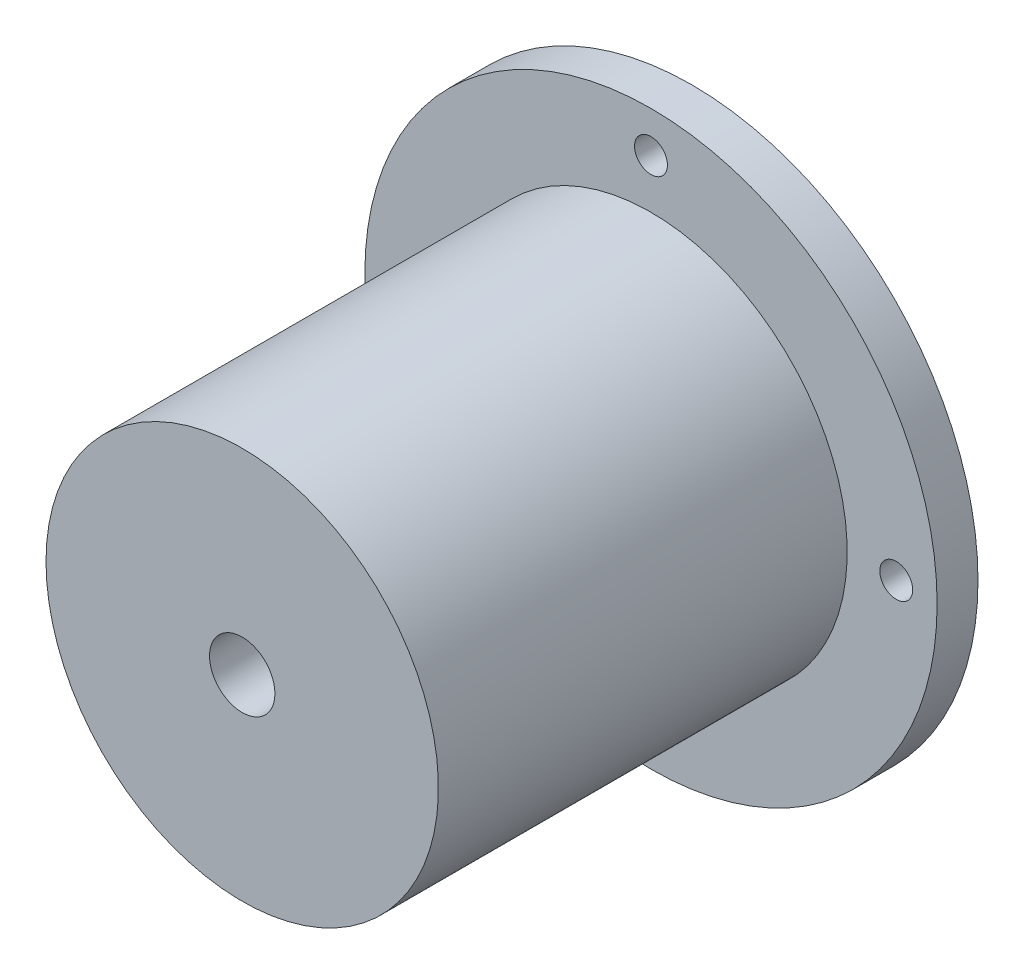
from build123d import *

# Parameters (mm, degrees)
SKETCH4_R          = 2.5527
CUT_EXTRUDE2_DEPTH = 94.971418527
CIRPATTERN1_COUNT  = 4
SKETCH5_R          = 5.08
CUT_EXTRUDE3_DEPTH = 94.971418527


with BuildPart() as part:
    # Sketch2 → Revolve1 (revolve)
    with BuildSketch(Plane(origin=(0, 0, 0), x_dir=(1, 0, 0), z_dir=(0, 1, 0))):
        Polygon((0, 0), (-30.48, 0), (-30.48, 63.5), (-44.45, 63.5), (-44.45, 69.85), (-22.86, 69.85), (-22.86, 12.7), (-17.5006, 12.7), (-17.5006, 7.62), (0, 7.62), align=None)
    revolve(axis=Axis((0, 0, -7.62), (0, 0, 1)))

    # Sketch4 → Cut-Extrude2 (cut, through all)
    with BuildSketch(Plane(origin=(0, 0, -69.85), x_dir=(-1, 0, 0), z_dir=(0, 0, -1))):
        with Locations((0, 38.1)):
            Circle(SKETCH4_R)
    cut_extrude2 = extrude(amount=-CUT_EXTRUDE2_DEPTH, mode=Mode.SUBTRACT)

    # CirPattern1: Cut-Extrude2 ×4 about axis
    cirpattern1_axis = Axis((0, 0, 0), (0, 0, 1))
    for i in range(1, CIRPATTERN1_COUNT):
        add(cut_extrude2.rotate(cirpattern1_axis, i * 360 / CIRPATTERN1_COUNT), mode=Mode.SUBTRACT)

    # Sketch5 → Cut-Extrude3 (cut, through all)
    with BuildSketch(Plane.XY):
        Circle(SKETCH5_R)
    extrude(amount=-CUT_EXTRUDE3_DEPTH, mode=Mode.SUBTRACT)


solid = part.part
